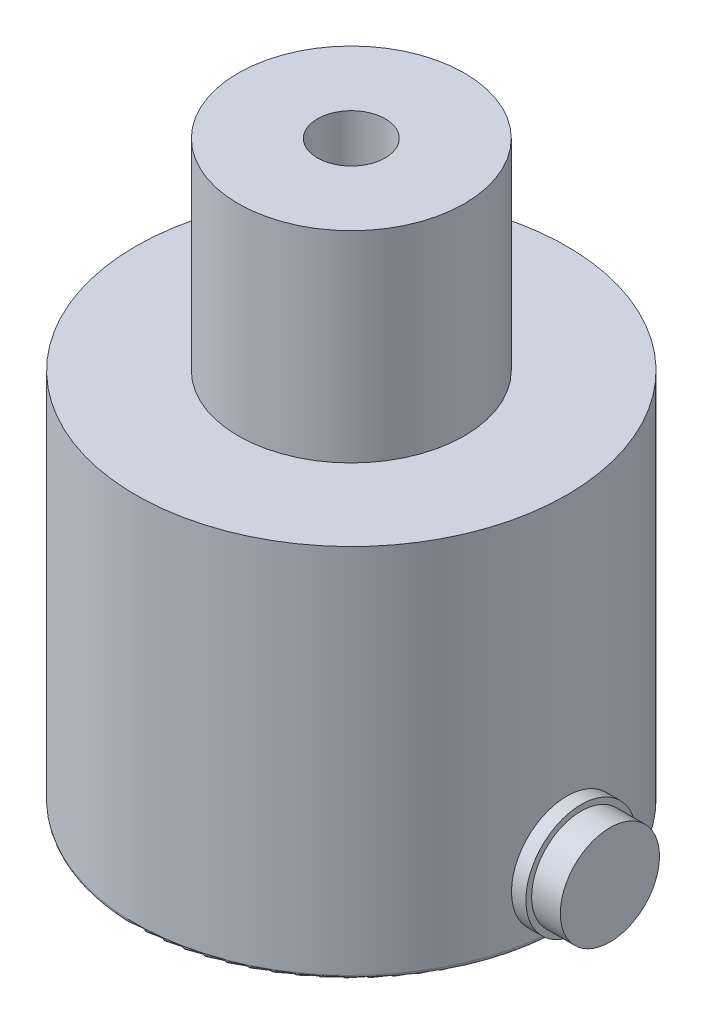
from build123d import *


with BuildPart() as part:
    # Sketch1 → Revolve1 (revolve)
    with BuildSketch(Plane.XY):
        with BuildLine():
            Line((19.05, -6.4405), (19.05, 16.61))
            Line((19.05, 16.61), (10, 16.61))
            Line((10, 16.61), (10, 21.65))
            Line((10, 21.65), (10, 34.39))
            Line((10, 34.39), (3, 34.39))
            Line((3, 34.39), (3, 21.69))
            Line((3, 21.69), (0, 21.69))
            Line((0, 21.69), (0, 0))
            Line((0, 0), (0, -16.61))
            Line((0, -16.61), (18.6595, -16.61))
            ThreePointArc((18.6595, -16.61), (18.935625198, -16.495625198), (19.05, -16.2195))
            Line((19.05, -16.2195), (19.05, -11.33))
            Line((19.05, -11.33), (19.05, -6.4405))
        make_face()
    revolve(axis=Axis((0, 0, 0), (0, 1, 0)))


with BuildPart() as body_2:
    # Sketch1_3 → Revolve2 (revolve)
    with BuildSketch(Plane.XY, mode=Mode.PRIVATE) as revolve2_sk:
        Polygon((20.32, -6.9485), (20.32, -11.33), (22.86, -11.33), (22.86, -7.2025), (22.86, -6.9485), align=None)
        Polygon((20.32, -6.4405), (19.05, -6.4405), (19.05, -11.33), (20.32, -11.33), (20.32, -6.9485), align=None)
    revolve(revolve2_sk.sketch.rotate(Axis((19.05, -11.33, 0), (1, 0, 0)), 90), axis=Axis((19.05, -11.33, 0), (1, 0, 0)))


solid = Compound([part.part, body_2.part])
